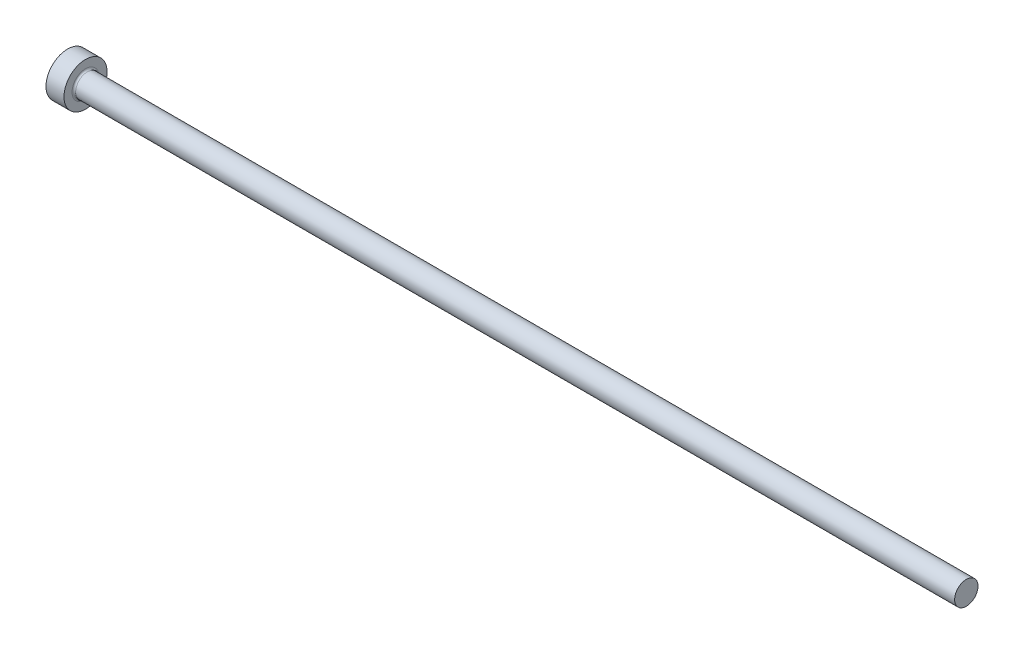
ISO-10303-21;
HEADER;
FILE_DESCRIPTION(('STEP AP214'),'2;1');
FILE_NAME('part.step','',(''),(''),'','','');
FILE_SCHEMA(('AUTOMOTIVE_DESIGN { 1 0 10303 214 1 1 1 1 }'));
ENDSEC;
DATA;
#1=APPLICATION_CONTEXT('core data for automotive mechanical design processes');
#2=APPLICATION_PROTOCOL_DEFINITION('international standard','automotive_design',2000,#1);
#3=PRODUCT_CONTEXT('',#1,'mechanical');
#4=PRODUCT('Part','Part','',(#3));
#5=PRODUCT_RELATED_PRODUCT_CATEGORY('part','',(#4));
#6=PRODUCT_DEFINITION_FORMATION('','',#4);
#7=PRODUCT_DEFINITION_CONTEXT('part definition',#1,'design');
#8=PRODUCT_DEFINITION('design','',#6,#7);
#9=PRODUCT_DEFINITION_SHAPE('','',#8);
#10=(LENGTH_UNIT() NAMED_UNIT(*) SI_UNIT(.MILLI.,.METRE.));
#11=(NAMED_UNIT(*) PLANE_ANGLE_UNIT() SI_UNIT($,.RADIAN.));
#12=(NAMED_UNIT(*) SI_UNIT($,.STERADIAN.) SOLID_ANGLE_UNIT());
#13=UNCERTAINTY_MEASURE_WITH_UNIT(LENGTH_MEASURE(1.E-05),#10,'distance_accuracy_value','');
#14=(GEOMETRIC_REPRESENTATION_CONTEXT(3) GLOBAL_UNCERTAINTY_ASSIGNED_CONTEXT((#13)) GLOBAL_UNIT_ASSIGNED_CONTEXT((#10,
#11,#12)) REPRESENTATION_CONTEXT('',''));
#15=CARTESIAN_POINT('',(0.,0.,0.));
#16=DIRECTION('',(0.,0.,1.));
#17=DIRECTION('',(1.,0.,0.));
#18=AXIS2_PLACEMENT_3D('',#15,#16,#17);
#19=CARTESIAN_POINT('',(0.,0.,0.));
#20=DIRECTION('',(-1.,0.,0.));
#21=DIRECTION('',(0.,-1.,0.));
#22=AXIS2_PLACEMENT_3D('',#19,#20,#21);
#23=PLANE('',#22);
#24=CARTESIAN_POINT('',(0.,0.,0.));
#25=DIRECTION('',(1.,0.,0.));
#26=DIRECTION('',(0.,1.,0.));
#27=AXIS2_PLACEMENT_3D('',#24,#25,#26);
#28=CIRCLE('',#27,6.);
#29=CARTESIAN_POINT('',(0.,6.,0.));
#30=VERTEX_POINT('',#29);
#31=EDGE_CURVE('E25',#30,#30,#28,.T.);
#32=ORIENTED_EDGE('',*,*,#31,.F.);
#33=EDGE_LOOP('',(#32));
#34=FACE_BOUND('',#33,.T.);
#35=ADVANCED_FACE('F14',(#34),#23,.T.);
#36=CARTESIAN_POINT('',(250.,0.,0.));
#37=DIRECTION('',(1.,0.,0.));
#38=DIRECTION('',(0.,1.,0.));
#39=AXIS2_PLACEMENT_3D('',#36,#37,#38);
#40=CYLINDRICAL_SURFACE('',#39,6.);
#41=ORIENTED_EDGE('',*,*,#31,.T.);
#42=EDGE_LOOP('',(#41));
#43=FACE_BOUND('',#42,.T.);
#44=CARTESIAN_POINT('',(5.,0.,0.));
#45=DIRECTION('',(1.,0.,0.));
#46=DIRECTION('',(0.,1.,0.));
#47=AXIS2_PLACEMENT_3D('',#44,#45,#46);
#48=CIRCLE('',#47,6.);
#49=CARTESIAN_POINT('',(5.,6.,0.));
#50=VERTEX_POINT('',#49);
#51=EDGE_CURVE('E29',#50,#50,#48,.T.);
#52=ORIENTED_EDGE('',*,*,#51,.F.);
#53=EDGE_LOOP('',(#52));
#54=FACE_BOUND('',#53,.T.);
#55=ADVANCED_FACE('F51',(#43,#54),#40,.T.);
#56=CARTESIAN_POINT('',(5.,6.,0.));
#57=DIRECTION('',(1.,0.,0.));
#58=DIRECTION('',(0.,1.,0.));
#59=AXIS2_PLACEMENT_3D('',#56,#57,#58);
#60=PLANE('',#59);
#61=CARTESIAN_POINT('',(5.,0.,0.));
#62=DIRECTION('',(1.,0.,0.));
#63=DIRECTION('',(0.,1.,0.));
#64=AXIS2_PLACEMENT_3D('',#61,#62,#63);
#65=CIRCLE('',#64,3.74999999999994);
#66=CARTESIAN_POINT('',(5.,3.74999999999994,0.));
#67=VERTEX_POINT('',#66);
#68=EDGE_CURVE('E9',#67,#67,#65,.F.);
#69=ORIENTED_EDGE('',*,*,#68,.T.);
#70=EDGE_LOOP('',(#69));
#71=FACE_BOUND('',#70,.T.);
#72=ORIENTED_EDGE('',*,*,#51,.T.);
#73=EDGE_LOOP('',(#72));
#74=FACE_BOUND('',#73,.T.);
#75=ADVANCED_FACE('F42',(#71,#74),#60,.T.);
#76=CARTESIAN_POINT('',(250.,0.,0.));
#77=DIRECTION('',(1.,0.,0.));
#78=DIRECTION('',(0.,1.,0.));
#79=AXIS2_PLACEMENT_3D('',#76,#77,#78);
#80=CYLINDRICAL_SURFACE('',#79,3.24999999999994);
#81=CARTESIAN_POINT('',(5.5,0.,0.));
#82=DIRECTION('',(1.,0.,0.));
#83=DIRECTION('',(0.,1.,0.));
#84=AXIS2_PLACEMENT_3D('',#81,#82,#83);
#85=CIRCLE('',#84,3.24999999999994);
#86=CARTESIAN_POINT('',(5.5,3.24999999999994,0.));
#87=VERTEX_POINT('',#86);
#88=EDGE_CURVE('E21',#87,#87,#85,.T.);
#89=ORIENTED_EDGE('',*,*,#88,.T.);
#90=EDGE_LOOP('',(#89));
#91=FACE_BOUND('',#90,.T.);
#92=CARTESIAN_POINT('',(250.,0.,0.));
#93=DIRECTION('',(1.,0.,0.));
#94=DIRECTION('',(0.,1.,0.));
#95=AXIS2_PLACEMENT_3D('',#92,#93,#94);
#96=CIRCLE('',#95,3.25);
#97=CARTESIAN_POINT('',(250.,3.25000000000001,0.));
#98=VERTEX_POINT('',#97);
#99=EDGE_CURVE('E34',#98,#98,#96,.T.);
#100=ORIENTED_EDGE('',*,*,#99,.F.);
#101=EDGE_LOOP('',(#100));
#102=FACE_BOUND('',#101,.T.);
#103=ADVANCED_FACE('F40',(#91,#102),#80,.T.);
#104=CARTESIAN_POINT('',(250.,3.25,0.));
#105=DIRECTION('',(1.,0.,0.));
#106=DIRECTION('',(0.,1.,0.));
#107=AXIS2_PLACEMENT_3D('',#104,#105,#106);
#108=PLANE('',#107);
#109=ORIENTED_EDGE('',*,*,#99,.T.);
#110=EDGE_LOOP('',(#109));
#111=FACE_BOUND('',#110,.T.);
#112=ADVANCED_FACE('F38',(#111),#108,.T.);
#113=CARTESIAN_POINT('',(5.5,0.,0.));
#114=DIRECTION('',(1.,0.,0.));
#115=DIRECTION('',(0.,1.,0.));
#116=AXIS2_PLACEMENT_3D('',#113,#114,#115);
#117=TOROIDAL_SURFACE('',#116,3.74999999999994,0.5);
#118=ORIENTED_EDGE('',*,*,#68,.F.);
#119=EDGE_LOOP('',(#118));
#120=FACE_BOUND('',#119,.T.);
#121=ORIENTED_EDGE('',*,*,#88,.F.);
#122=EDGE_LOOP('',(#121));
#123=FACE_BOUND('',#122,.T.);
#124=ADVANCED_FACE('F16',(#120,#123),#117,.F.);
#125=CLOSED_SHELL('',(#35,#55,#75,#103,#112,#124));
#126=MANIFOLD_SOLID_BREP('B1',#125);
#127=ADVANCED_BREP_SHAPE_REPRESENTATION('',(#18,#126),#14);
#128=SHAPE_DEFINITION_REPRESENTATION(#9,#127);
ENDSEC;
END-ISO-10303-21;
